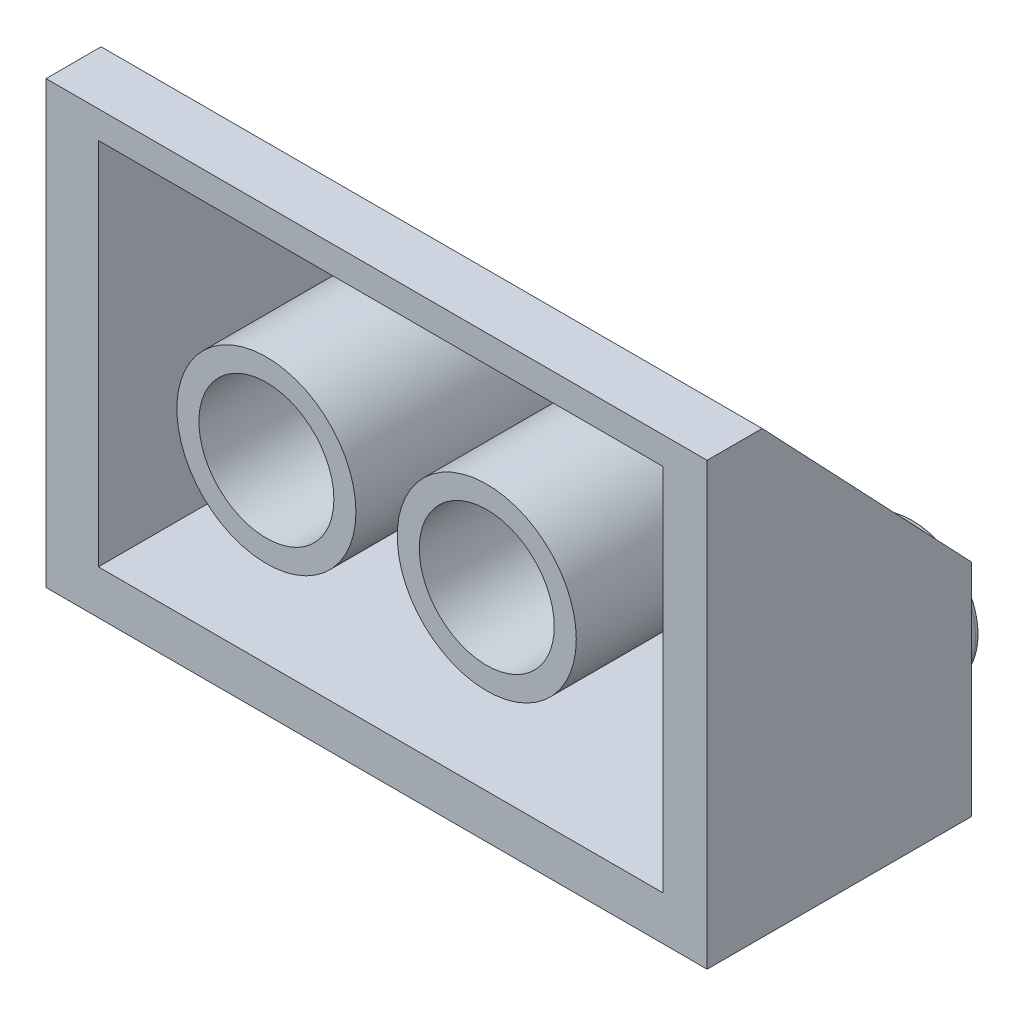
ISO-10303-21;
HEADER;
FILE_DESCRIPTION(('STEP AP214'),'2;1');
FILE_NAME('part.step','',(''),(''),'','','');
FILE_SCHEMA(('AUTOMOTIVE_DESIGN { 1 0 10303 214 1 1 1 1 }'));
ENDSEC;
DATA;
#1=APPLICATION_CONTEXT('core data for automotive mechanical design processes');
#2=APPLICATION_PROTOCOL_DEFINITION('international standard','automotive_design',2000,#1);
#3=PRODUCT_CONTEXT('',#1,'mechanical');
#4=PRODUCT('Part','Part','',(#3));
#5=PRODUCT_RELATED_PRODUCT_CATEGORY('part','',(#4));
#6=PRODUCT_DEFINITION_FORMATION('','',#4);
#7=PRODUCT_DEFINITION_CONTEXT('part definition',#1,'design');
#8=PRODUCT_DEFINITION('design','',#6,#7);
#9=PRODUCT_DEFINITION_SHAPE('','',#8);
#10=(LENGTH_UNIT() NAMED_UNIT(*) SI_UNIT(.MILLI.,.METRE.));
#11=(NAMED_UNIT(*) PLANE_ANGLE_UNIT() SI_UNIT($,.RADIAN.));
#12=(NAMED_UNIT(*) SI_UNIT($,.STERADIAN.) SOLID_ANGLE_UNIT());
#13=UNCERTAINTY_MEASURE_WITH_UNIT(LENGTH_MEASURE(1.E-05),#10,'distance_accuracy_value','');
#14=(GEOMETRIC_REPRESENTATION_CONTEXT(3) GLOBAL_UNCERTAINTY_ASSIGNED_CONTEXT((#13)) GLOBAL_UNIT_ASSIGNED_CONTEXT((#10,
#11,#12)) REPRESENTATION_CONTEXT('',''));
#15=CARTESIAN_POINT('',(0.,0.,0.));
#16=DIRECTION('',(0.,0.,1.));
#17=DIRECTION('',(1.,0.,0.));
#18=AXIS2_PLACEMENT_3D('',#15,#16,#17);
#19=CARTESIAN_POINT('',(0.,0.,0.));
#20=DIRECTION('',(0.,0.,-1.));
#21=DIRECTION('',(-1.,0.,0.));
#22=AXIS2_PLACEMENT_3D('',#19,#20,#21);
#23=PLANE('',#22);
#24=CARTESIAN_POINT('',(-4.,-4.,0.));
#25=DIRECTION('',(0.,0.,-1.));
#26=DIRECTION('',(-1.,0.,0.));
#27=AXIS2_PLACEMENT_3D('',#24,#25,#26);
#28=CIRCLE('',#27,2.45);
#29=CARTESIAN_POINT('',(-1.55,-4.,0.));
#30=VERTEX_POINT('',#29);
#31=EDGE_CURVE('E159',#30,#30,#28,.T.);
#32=ORIENTED_EDGE('',*,*,#31,.F.);
#33=EDGE_LOOP('',(#32));
#34=FACE_BOUND('',#33,.T.);
#35=DIRECTION('',(0.,1.,0.));
#36=VECTOR('',#35,1.);
#37=CARTESIAN_POINT('',(0.,0.,0.));
#38=LINE('',#37,#36);
#39=CARTESIAN_POINT('',(0.,-8.,0.));
#40=VERTEX_POINT('',#39);
#41=CARTESIAN_POINT('',(0.,0.,0.));
#42=VERTEX_POINT('',#41);
#43=EDGE_CURVE('E337',#40,#42,#38,.T.);
#44=ORIENTED_EDGE('',*,*,#43,.F.);
#45=DIRECTION('',(1.,0.,0.));
#46=VECTOR('',#45,1.);
#47=CARTESIAN_POINT('',(0.,-8.,0.));
#48=LINE('',#47,#46);
#49=CARTESIAN_POINT('',(-24.,-8.,0.));
#50=VERTEX_POINT('',#49);
#51=EDGE_CURVE('E346',#50,#40,#48,.T.);
#52=ORIENTED_EDGE('',*,*,#51,.F.);
#53=DIRECTION('',(0.,-1.,0.));
#54=VECTOR('',#53,1.);
#55=CARTESIAN_POINT('',(-24.,0.,0.));
#56=LINE('',#55,#54);
#57=CARTESIAN_POINT('',(-24.,0.,0.));
#58=VERTEX_POINT('',#57);
#59=EDGE_CURVE('E344',#58,#50,#56,.T.);
#60=ORIENTED_EDGE('',*,*,#59,.F.);
#61=DIRECTION('',(-1.,0.,0.));
#62=VECTOR('',#61,1.);
#63=CARTESIAN_POINT('',(0.,0.,0.));
#64=LINE('',#63,#62);
#65=EDGE_CURVE('E341',#42,#58,#64,.T.);
#66=ORIENTED_EDGE('',*,*,#65,.F.);
#67=EDGE_LOOP('',(#44,#52,#60,#66));
#68=FACE_BOUND('',#67,.T.);
#69=CARTESIAN_POINT('',(-12.,-4.,0.));
#70=DIRECTION('',(0.,0.,-1.));
#71=DIRECTION('',(-1.,0.,0.));
#72=AXIS2_PLACEMENT_3D('',#69,#70,#71);
#73=CIRCLE('',#72,2.45);
#74=CARTESIAN_POINT('',(-9.55,-4.,0.));
#75=VERTEX_POINT('',#74);
#76=EDGE_CURVE('E424',#75,#75,#73,.T.);
#77=ORIENTED_EDGE('',*,*,#76,.F.);
#78=EDGE_LOOP('',(#77));
#79=FACE_BOUND('',#78,.T.);
#80=CARTESIAN_POINT('',(-20.,-4.,0.));
#81=DIRECTION('',(0.,0.,-1.));
#82=DIRECTION('',(-1.,0.,0.));
#83=AXIS2_PLACEMENT_3D('',#80,#81,#82);
#84=CIRCLE('',#83,2.45);
#85=CARTESIAN_POINT('',(-17.55,-4.,0.));
#86=VERTEX_POINT('',#85);
#87=EDGE_CURVE('E167',#86,#86,#84,.T.);
#88=ORIENTED_EDGE('',*,*,#87,.F.);
#89=EDGE_LOOP('',(#88));
#90=FACE_BOUND('',#89,.T.);
#91=ADVANCED_FACE('F26',(#34,#68,#79,#90),#23,.T.);
#92=CARTESIAN_POINT('',(0.,0.,9.6));
#93=DIRECTION('',(0.,0.,-1.));
#94=DIRECTION('',(-1.,0.,0.));
#95=AXIS2_PLACEMENT_3D('',#92,#93,#94);
#96=PLANE('',#95);
#97=DIRECTION('',(0.,1.,0.));
#98=VECTOR('',#97,1.);
#99=CARTESIAN_POINT('',(0.,0.,9.6));
#100=LINE('',#99,#98);
#101=CARTESIAN_POINT('',(0.,-8.,9.6));
#102=VERTEX_POINT('',#101);
#103=CARTESIAN_POINT('',(0.,8.,9.6));
#104=VERTEX_POINT('',#103);
#105=EDGE_CURVE('E348',#102,#104,#100,.T.);
#106=ORIENTED_EDGE('',*,*,#105,.T.);
#107=DIRECTION('',(1.,0.,0.));
#108=VECTOR('',#107,1.);
#109=CARTESIAN_POINT('',(-24.,7.99999999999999,9.6));
#110=LINE('',#109,#108);
#111=CARTESIAN_POINT('',(-24.,7.99999999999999,9.6));
#112=VERTEX_POINT('',#111);
#113=EDGE_CURVE('E385',#112,#104,#110,.T.);
#114=ORIENTED_EDGE('',*,*,#113,.F.);
#115=DIRECTION('',(0.,-1.,0.));
#116=VECTOR('',#115,1.);
#117=CARTESIAN_POINT('',(-24.,0.,9.6));
#118=LINE('',#117,#116);
#119=CARTESIAN_POINT('',(-24.,-8.,9.6));
#120=VERTEX_POINT('',#119);
#121=EDGE_CURVE('E350',#112,#120,#118,.T.);
#122=ORIENTED_EDGE('',*,*,#121,.T.);
#123=DIRECTION('',(1.,0.,0.));
#124=VECTOR('',#123,1.);
#125=CARTESIAN_POINT('',(0.,-8.,9.6));
#126=LINE('',#125,#124);
#127=EDGE_CURVE('E352',#120,#102,#126,.T.);
#128=ORIENTED_EDGE('',*,*,#127,.T.);
#129=EDGE_LOOP('',(#106,#114,#122,#128));
#130=FACE_BOUND('',#129,.T.);
#131=DIRECTION('',(-1.,0.,0.));
#132=VECTOR('',#131,1.);
#133=CARTESIAN_POINT('',(-1.6,7.00522470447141,9.6));
#134=LINE('',#133,#132);
#135=CARTESIAN_POINT('',(-1.6,7.00522470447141,9.6));
#136=VERTEX_POINT('',#135);
#137=CARTESIAN_POINT('',(-22.1,7.0052247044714,9.6));
#138=VERTEX_POINT('',#137);
#139=EDGE_CURVE('E377',#136,#138,#134,.T.);
#140=ORIENTED_EDGE('',*,*,#139,.F.);
#141=DIRECTION('',(0.,1.,0.));
#142=VECTOR('',#141,1.);
#143=CARTESIAN_POINT('',(-1.6,-6.4,9.6));
#144=LINE('',#143,#142);
#145=CARTESIAN_POINT('',(-1.6,-6.4,9.6));
#146=VERTEX_POINT('',#145);
#147=EDGE_CURVE('E156',#146,#136,#144,.T.);
#148=ORIENTED_EDGE('',*,*,#147,.F.);
#149=DIRECTION('',(1.,0.,0.));
#150=VECTOR('',#149,1.);
#151=CARTESIAN_POINT('',(-1.6,-6.4,9.6));
#152=LINE('',#151,#150);
#153=CARTESIAN_POINT('',(-22.1,-6.40000000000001,9.6));
#154=VERTEX_POINT('',#153);
#155=EDGE_CURVE('E158',#154,#146,#152,.T.);
#156=ORIENTED_EDGE('',*,*,#155,.F.);
#157=DIRECTION('',(0.,1.,0.));
#158=VECTOR('',#157,1.);
#159=CARTESIAN_POINT('',(-22.1,0.,9.6));
#160=LINE('',#159,#158);
#161=EDGE_CURVE('E139',#154,#138,#160,.T.);
#162=ORIENTED_EDGE('',*,*,#161,.T.);
#163=EDGE_LOOP('',(#140,#148,#156,#162));
#164=FACE_BOUND('',#163,.T.);
#165=ADVANCED_FACE('F196',(#130,#164),#96,.F.);
#166=CARTESIAN_POINT('',(0.,0.,9.6));
#167=DIRECTION('',(-1.,0.,0.));
#168=DIRECTION('',(0.,-1.,0.));
#169=AXIS2_PLACEMENT_3D('',#166,#167,#168);
#170=PLANE('',#169);
#171=ORIENTED_EDGE('',*,*,#43,.T.);
#172=DIRECTION('',(0.,0.724999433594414,0.688749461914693));
#173=VECTOR('',#172,1.);
#174=CARTESIAN_POINT('',(0.,0.,0.));
#175=LINE('',#174,#173);
#176=CARTESIAN_POINT('',(0.,8.,7.6));
#177=VERTEX_POINT('',#176);
#178=EDGE_CURVE('E365',#42,#177,#175,.T.);
#179=ORIENTED_EDGE('',*,*,#178,.T.);
#180=DIRECTION('',(0.,0.,1.));
#181=VECTOR('',#180,1.);
#182=CARTESIAN_POINT('',(0.,8.,7.6));
#183=LINE('',#182,#181);
#184=EDGE_CURVE('E371',#177,#104,#183,.T.);
#185=ORIENTED_EDGE('',*,*,#184,.T.);
#186=ORIENTED_EDGE('',*,*,#105,.F.);
#187=DIRECTION('',(0.,0.,-1.));
#188=VECTOR('',#187,1.);
#189=CARTESIAN_POINT('',(0.,-8.,9.6));
#190=LINE('',#189,#188);
#191=EDGE_CURVE('E353',#102,#40,#190,.T.);
#192=ORIENTED_EDGE('',*,*,#191,.T.);
#193=EDGE_LOOP('',(#171,#179,#185,#186,#192));
#194=FACE_BOUND('',#193,.T.);
#195=ADVANCED_FACE('F203',(#194),#170,.F.);
#196=CARTESIAN_POINT('',(-24.,0.,9.6));
#197=DIRECTION('',(1.,0.,0.));
#198=DIRECTION('',(0.,0.,-1.));
#199=AXIS2_PLACEMENT_3D('',#196,#197,#198);
#200=PLANE('',#199);
#201=ORIENTED_EDGE('',*,*,#59,.T.);
#202=DIRECTION('',(0.,0.,-1.));
#203=VECTOR('',#202,1.);
#204=CARTESIAN_POINT('',(-24.,-8.,9.6));
#205=LINE('',#204,#203);
#206=EDGE_CURVE('E145',#120,#50,#205,.T.);
#207=ORIENTED_EDGE('',*,*,#206,.F.);
#208=ORIENTED_EDGE('',*,*,#121,.F.);
#209=DIRECTION('',(0.,0.,1.));
#210=VECTOR('',#209,1.);
#211=CARTESIAN_POINT('',(-24.,7.99999999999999,7.6));
#212=LINE('',#211,#210);
#213=CARTESIAN_POINT('',(-24.,7.99999999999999,7.6));
#214=VERTEX_POINT('',#213);
#215=EDGE_CURVE('E382',#214,#112,#212,.T.);
#216=ORIENTED_EDGE('',*,*,#215,.F.);
#217=DIRECTION('',(0.,0.724999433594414,0.688749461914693));
#218=VECTOR('',#217,1.);
#219=CARTESIAN_POINT('',(-24.,0.,0.));
#220=LINE('',#219,#218);
#221=EDGE_CURVE('E374',#58,#214,#220,.T.);
#222=ORIENTED_EDGE('',*,*,#221,.F.);
#223=EDGE_LOOP('',(#201,#207,#208,#216,#222));
#224=FACE_BOUND('',#223,.T.);
#225=ADVANCED_FACE('F216',(#224),#200,.F.);
#226=CARTESIAN_POINT('',(0.,-8.,9.6));
#227=DIRECTION('',(0.,1.,0.));
#228=DIRECTION('',(-1.,0.,0.));
#229=AXIS2_PLACEMENT_3D('',#226,#227,#228);
#230=PLANE('',#229);
#231=ORIENTED_EDGE('',*,*,#51,.T.);
#232=ORIENTED_EDGE('',*,*,#191,.F.);
#233=ORIENTED_EDGE('',*,*,#127,.F.);
#234=ORIENTED_EDGE('',*,*,#206,.T.);
#235=EDGE_LOOP('',(#231,#232,#233,#234));
#236=FACE_BOUND('',#235,.T.);
#237=ADVANCED_FACE('F212',(#236),#230,.F.);
#238=CARTESIAN_POINT('',(-1.6,6.2,1.1));
#239=DIRECTION('',(0.,0.,1.));
#240=DIRECTION('',(1.,0.,0.));
#241=AXIS2_PLACEMENT_3D('',#238,#239,#240);
#242=PLANE('',#241);
#243=CARTESIAN_POINT('',(-16.,0.,1.1));
#244=DIRECTION('',(0.,0.,1.));
#245=DIRECTION('',(1.,0.,0.));
#246=AXIS2_PLACEMENT_3D('',#243,#244,#245);
#247=CIRCLE('',#246,3.25);
#248=CARTESIAN_POINT('',(-19.25,0.,1.1));
#249=VERTEX_POINT('',#248);
#250=CARTESIAN_POINT('',(-12.75,0.,1.1));
#251=VERTEX_POINT('',#250);
#252=EDGE_CURVE('E439',#249,#251,#247,.T.);
#253=ORIENTED_EDGE('',*,*,#252,.F.);
#254=DIRECTION('',(-1.,0.,0.));
#255=VECTOR('',#254,1.);
#256=CARTESIAN_POINT('',(0.,0.,1.1));
#257=LINE('',#256,#255);
#258=CARTESIAN_POINT('',(-22.1,0.,1.1));
#259=VERTEX_POINT('',#258);
#260=EDGE_CURVE('E136',#249,#259,#257,.T.);
#261=ORIENTED_EDGE('',*,*,#260,.T.);
#262=DIRECTION('',(0.,-1.,0.));
#263=VECTOR('',#262,1.);
#264=CARTESIAN_POINT('',(-22.1,-6.40000000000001,1.1));
#265=LINE('',#264,#263);
#266=CARTESIAN_POINT('',(-22.1,-6.40000000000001,1.1));
#267=VERTEX_POINT('',#266);
#268=EDGE_CURVE('E330',#259,#267,#265,.T.);
#269=ORIENTED_EDGE('',*,*,#268,.T.);
#270=DIRECTION('',(1.,0.,0.));
#271=VECTOR('',#270,1.);
#272=CARTESIAN_POINT('',(-1.6,-6.4,1.1));
#273=LINE('',#272,#271);
#274=CARTESIAN_POINT('',(-1.6,-6.4,1.1));
#275=VERTEX_POINT('',#274);
#276=EDGE_CURVE('E324',#267,#275,#273,.T.);
#277=ORIENTED_EDGE('',*,*,#276,.T.);
#278=DIRECTION('',(0.,1.,0.));
#279=VECTOR('',#278,1.);
#280=CARTESIAN_POINT('',(-1.6,-6.4,1.1));
#281=LINE('',#280,#279);
#282=CARTESIAN_POINT('',(-1.6,0.,1.1));
#283=VERTEX_POINT('',#282);
#284=EDGE_CURVE('E327',#275,#283,#281,.T.);
#285=ORIENTED_EDGE('',*,*,#284,.T.);
#286=CARTESIAN_POINT('',(-4.75,0.,1.1));
#287=VERTEX_POINT('',#286);
#288=EDGE_CURVE('E140',#283,#287,#257,.T.);
#289=ORIENTED_EDGE('',*,*,#288,.T.);
#290=CARTESIAN_POINT('',(-8.,0.,1.1));
#291=DIRECTION('',(0.,0.,1.));
#292=DIRECTION('',(1.,0.,0.));
#293=AXIS2_PLACEMENT_3D('',#290,#291,#292);
#294=CIRCLE('',#293,3.25);
#295=CARTESIAN_POINT('',(-11.25,0.,1.1));
#296=VERTEX_POINT('',#295);
#297=EDGE_CURVE('E400',#296,#287,#294,.T.);
#298=ORIENTED_EDGE('',*,*,#297,.F.);
#299=EDGE_CURVE('E135',#296,#251,#257,.T.);
#300=ORIENTED_EDGE('',*,*,#299,.T.);
#301=EDGE_LOOP('',(#253,#261,#269,#277,#285,#289,#298,#300));
#302=FACE_BOUND('',#301,.T.);
#303=CARTESIAN_POINT('',(-20.,-4.00000000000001,1.1));
#304=DIRECTION('',(0.,0.,1.));
#305=DIRECTION('',(1.,0.,0.));
#306=AXIS2_PLACEMENT_3D('',#303,#304,#305);
#307=CIRCLE('',#306,1.25);
#308=CARTESIAN_POINT('',(-18.75,-4.00000000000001,1.1));
#309=VERTEX_POINT('',#308);
#310=EDGE_CURVE('E436',#309,#309,#307,.T.);
#311=ORIENTED_EDGE('',*,*,#310,.F.);
#312=EDGE_LOOP('',(#311));
#313=FACE_BOUND('',#312,.T.);
#314=CARTESIAN_POINT('',(-12.,-4.,1.1));
#315=DIRECTION('',(0.,0.,1.));
#316=DIRECTION('',(1.,0.,0.));
#317=AXIS2_PLACEMENT_3D('',#314,#315,#316);
#318=CIRCLE('',#317,1.25);
#319=CARTESIAN_POINT('',(-10.75,-4.,1.1));
#320=VERTEX_POINT('',#319);
#321=EDGE_CURVE('E430',#320,#320,#318,.T.);
#322=ORIENTED_EDGE('',*,*,#321,.F.);
#323=EDGE_LOOP('',(#322));
#324=FACE_BOUND('',#323,.T.);
#325=CARTESIAN_POINT('',(-4.,-4.,1.1));
#326=DIRECTION('',(0.,0.,1.));
#327=DIRECTION('',(1.,0.,0.));
#328=AXIS2_PLACEMENT_3D('',#325,#326,#327);
#329=CIRCLE('',#328,1.25);
#330=CARTESIAN_POINT('',(-2.75,-4.,1.1));
#331=VERTEX_POINT('',#330);
#332=EDGE_CURVE('E415',#331,#331,#329,.T.);
#333=ORIENTED_EDGE('',*,*,#332,.F.);
#334=EDGE_LOOP('',(#333));
#335=FACE_BOUND('',#334,.T.);
#336=ADVANCED_FACE('F215',(#302,#313,#324,#335),#242,.T.);
#337=CARTESIAN_POINT('',(-1.6,-6.4,1.1));
#338=DIRECTION('',(1.,0.,0.));
#339=DIRECTION('',(0.,0.,-1.));
#340=AXIS2_PLACEMENT_3D('',#337,#338,#339);
#341=PLANE('',#340);
#342=ORIENTED_EDGE('',*,*,#284,.F.);
#343=DIRECTION('',(0.,0.,1.));
#344=VECTOR('',#343,1.);
#345=CARTESIAN_POINT('',(-1.6,-6.4,1.1));
#346=LINE('',#345,#344);
#347=EDGE_CURVE('E325',#275,#146,#346,.T.);
#348=ORIENTED_EDGE('',*,*,#347,.T.);
#349=ORIENTED_EDGE('',*,*,#147,.T.);
#350=DIRECTION('',(0.,0.,1.));
#351=VECTOR('',#350,1.);
#352=CARTESIAN_POINT('',(-1.6,7.00522470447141,7.8));
#353=LINE('',#352,#351);
#354=CARTESIAN_POINT('',(-1.6,7.00522470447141,7.8));
#355=VERTEX_POINT('',#354);
#356=EDGE_CURVE('E392',#355,#136,#353,.T.);
#357=ORIENTED_EDGE('',*,*,#356,.F.);
#358=DIRECTION('',(0.,0.722675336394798,0.691187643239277));
#359=VECTOR('',#358,1.);
#360=CARTESIAN_POINT('',(-1.6,0.,1.1));
#361=LINE('',#360,#359);
#362=EDGE_CURVE('E395',#283,#355,#361,.T.);
#363=ORIENTED_EDGE('',*,*,#362,.F.);
#364=EDGE_LOOP('',(#342,#348,#349,#357,#363));
#365=FACE_BOUND('',#364,.T.);
#366=ADVANCED_FACE('F209',(#365),#341,.F.);
#367=CARTESIAN_POINT('',(-22.1,-6.40000000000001,1.1));
#368=DIRECTION('',(-1.,0.,0.));
#369=DIRECTION('',(0.,0.,1.));
#370=AXIS2_PLACEMENT_3D('',#367,#368,#369);
#371=PLANE('',#370);
#372=ORIENTED_EDGE('',*,*,#161,.F.);
#373=DIRECTION('',(0.,0.,1.));
#374=VECTOR('',#373,1.);
#375=CARTESIAN_POINT('',(-22.1,-6.40000000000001,1.1));
#376=LINE('',#375,#374);
#377=EDGE_CURVE('E313',#267,#154,#376,.T.);
#378=ORIENTED_EDGE('',*,*,#377,.F.);
#379=ORIENTED_EDGE('',*,*,#268,.F.);
#380=DIRECTION('',(0.,0.722675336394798,0.691187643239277));
#381=VECTOR('',#380,1.);
#382=CARTESIAN_POINT('',(-22.1,0.,1.1));
#383=LINE('',#382,#381);
#384=CARTESIAN_POINT('',(-22.1,7.0052247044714,7.8));
#385=VERTEX_POINT('',#384);
#386=EDGE_CURVE('E398',#259,#385,#383,.T.);
#387=ORIENTED_EDGE('',*,*,#386,.T.);
#388=DIRECTION('',(0.,0.,1.));
#389=VECTOR('',#388,1.);
#390=CARTESIAN_POINT('',(-22.1,7.0052247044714,7.8));
#391=LINE('',#390,#389);
#392=EDGE_CURVE('E316',#385,#138,#391,.T.);
#393=ORIENTED_EDGE('',*,*,#392,.T.);
#394=EDGE_LOOP('',(#372,#378,#379,#387,#393));
#395=FACE_BOUND('',#394,.T.);
#396=ADVANCED_FACE('F301',(#395),#371,.F.);
#397=CARTESIAN_POINT('',(-1.6,-6.4,1.1));
#398=DIRECTION('',(0.,-1.,0.));
#399=DIRECTION('',(1.,0.,0.));
#400=AXIS2_PLACEMENT_3D('',#397,#398,#399);
#401=PLANE('',#400);
#402=ORIENTED_EDGE('',*,*,#155,.T.);
#403=ORIENTED_EDGE('',*,*,#347,.F.);
#404=ORIENTED_EDGE('',*,*,#276,.F.);
#405=ORIENTED_EDGE('',*,*,#377,.T.);
#406=EDGE_LOOP('',(#402,#403,#404,#405));
#407=FACE_BOUND('',#406,.T.);
#408=ADVANCED_FACE('F295',(#407),#401,.F.);
#409=CARTESIAN_POINT('',(-4.,-4.,-1.9));
#410=DIRECTION('',(0.,0.,1.));
#411=DIRECTION('',(1.,0.,0.));
#412=AXIS2_PLACEMENT_3D('',#409,#410,#411);
#413=CYLINDRICAL_SURFACE('',#412,2.45);
#414=CARTESIAN_POINT('',(-4.,-4.,-1.7));
#415=DIRECTION('',(0.,0.,-1.));
#416=DIRECTION('',(-1.,0.,0.));
#417=AXIS2_PLACEMENT_3D('',#414,#415,#416);
#418=CIRCLE('',#417,2.45);
#419=CARTESIAN_POINT('',(-1.55,-4.,-1.7));
#420=VERTEX_POINT('',#419);
#421=EDGE_CURVE('E149',#420,#420,#418,.F.);
#422=CARTESIAN_POINT('',(-1.55,-4.,-1.7));
#423=CARTESIAN_POINT('',(-1.55,-4.,-1.68229166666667));
#424=CARTESIAN_POINT('',(-1.55,-4.,-1.66458333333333));
#425=CARTESIAN_POINT('',(-1.55,-4.,-1.62916666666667));
#426=CARTESIAN_POINT('',(-1.55,-4.,-1.61145833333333));
#427=CARTESIAN_POINT('',(-1.55,-4.,-1.57604166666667));
#428=CARTESIAN_POINT('',(-1.55,-4.,-1.55833333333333));
#429=CARTESIAN_POINT('',(-1.55,-4.,-1.52291666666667));
#430=CARTESIAN_POINT('',(-1.55,-4.,-1.50520833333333));
#431=CARTESIAN_POINT('',(-1.55,-4.,-1.46979166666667));
#432=CARTESIAN_POINT('',(-1.55,-4.,-1.45208333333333));
#433=CARTESIAN_POINT('',(-1.55,-4.,-1.41666666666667));
#434=CARTESIAN_POINT('',(-1.55,-4.,-1.39895833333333));
#435=CARTESIAN_POINT('',(-1.55,-4.,-1.36354166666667));
#436=CARTESIAN_POINT('',(-1.55,-4.,-1.34583333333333));
#437=CARTESIAN_POINT('',(-1.55,-4.,-1.31041666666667));
#438=CARTESIAN_POINT('',(-1.55,-4.,-1.29270833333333));
#439=CARTESIAN_POINT('',(-1.55,-4.,-1.25729166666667));
#440=CARTESIAN_POINT('',(-1.55,-4.,-1.23958333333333));
#441=CARTESIAN_POINT('',(-1.55,-4.,-1.20416666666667));
#442=CARTESIAN_POINT('',(-1.55,-4.,-1.18645833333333));
#443=CARTESIAN_POINT('',(-1.55,-4.,-1.15104166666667));
#444=CARTESIAN_POINT('',(-1.55,-4.,-1.13333333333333));
#445=CARTESIAN_POINT('',(-1.55,-4.,-1.09791666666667));
#446=CARTESIAN_POINT('',(-1.55,-4.,-1.08020833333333));
#447=CARTESIAN_POINT('',(-1.55,-4.,-1.04479166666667));
#448=CARTESIAN_POINT('',(-1.55,-4.,-1.02708333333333));
#449=CARTESIAN_POINT('',(-1.55,-4.,-0.991666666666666));
#450=CARTESIAN_POINT('',(-1.55,-4.,-0.973958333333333));
#451=CARTESIAN_POINT('',(-1.55,-4.,-0.938541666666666));
#452=CARTESIAN_POINT('',(-1.55,-4.,-0.920833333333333));
#453=CARTESIAN_POINT('',(-1.55,-4.,-0.885416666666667));
#454=CARTESIAN_POINT('',(-1.55,-4.,-0.867708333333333));
#455=CARTESIAN_POINT('',(-1.55,-4.,-0.832291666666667));
#456=CARTESIAN_POINT('',(-1.55,-4.,-0.814583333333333));
#457=CARTESIAN_POINT('',(-1.55,-4.,-0.779166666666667));
#458=CARTESIAN_POINT('',(-1.55,-4.,-0.761458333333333));
#459=CARTESIAN_POINT('',(-1.55,-4.,-0.726041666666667));
#460=CARTESIAN_POINT('',(-1.55,-4.,-0.708333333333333));
#461=CARTESIAN_POINT('',(-1.55,-4.,-0.672916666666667));
#462=CARTESIAN_POINT('',(-1.55,-4.,-0.655208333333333));
#463=CARTESIAN_POINT('',(-1.55,-4.,-0.619791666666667));
#464=CARTESIAN_POINT('',(-1.55,-4.,-0.602083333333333));
#465=CARTESIAN_POINT('',(-1.55,-4.,-0.566666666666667));
#466=CARTESIAN_POINT('',(-1.55,-4.,-0.548958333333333));
#467=CARTESIAN_POINT('',(-1.55,-4.,-0.513541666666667));
#468=CARTESIAN_POINT('',(-1.55,-4.,-0.495833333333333));
#469=CARTESIAN_POINT('',(-1.55,-4.,-0.460416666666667));
#470=CARTESIAN_POINT('',(-1.55,-4.,-0.442708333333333));
#471=CARTESIAN_POINT('',(-1.55,-4.,-0.407291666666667));
#472=CARTESIAN_POINT('',(-1.55,-4.,-0.389583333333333));
#473=CARTESIAN_POINT('',(-1.55,-4.,-0.354166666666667));
#474=CARTESIAN_POINT('',(-1.55,-4.,-0.336458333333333));
#475=CARTESIAN_POINT('',(-1.55,-4.,-0.301041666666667));
#476=CARTESIAN_POINT('',(-1.55,-4.,-0.283333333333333));
#477=CARTESIAN_POINT('',(-1.55,-4.,-0.247916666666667));
#478=CARTESIAN_POINT('',(-1.55,-4.,-0.230208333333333));
#479=CARTESIAN_POINT('',(-1.55,-4.,-0.194791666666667));
#480=CARTESIAN_POINT('',(-1.55,-4.,-0.177083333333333));
#481=CARTESIAN_POINT('',(-1.55,-4.,-0.141666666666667));
#482=CARTESIAN_POINT('',(-1.55,-4.,-0.123958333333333));
#483=CARTESIAN_POINT('',(-1.55,-4.,-0.0885416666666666));
#484=CARTESIAN_POINT('',(-1.55,-4.,-0.0708333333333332));
#485=CARTESIAN_POINT('',(-1.55,-4.,-0.0354166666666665));
#486=CARTESIAN_POINT('',(-1.55,-4.,-0.0177083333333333));
#487=CARTESIAN_POINT('',(-1.55,-4.,0.));
#488=B_SPLINE_CURVE_WITH_KNOTS('',3,(#422,#423,#424,#425,#426,#427,#428,#429,#430,#431,#432,
#433,#434,#435,#436,#437,#438,#439,#440,#441,#442,#443,#444,#445,#446,#447,#448,#449,#450,#451,
#452,#453,#454,#455,#456,#457,#458,#459,#460,#461,#462,#463,#464,#465,#466,#467,#468,#469,#470,
#471,#472,#473,#474,#475,#476,#477,#478,#479,#480,#481,#482,#483,#484,#485,#486,#487),
.UNSPECIFIED.,.F.,.F.,(4,2,2,2,2,2,2,2,2,2,2,2,2,2,2,2,2,2,2,2,2,2,2,2,2,2,2,2,2,2,2,2,4),(0.,
0.053125,0.10625,0.159375,0.2125,0.265625,0.31875,0.371875,0.425,0.478125,0.53125,0.584375,
0.6375,0.690625,0.74375,0.796875,0.85,0.903125,0.95625,1.009375,1.0625,1.115625,1.16875,
1.221875,1.275,1.328125,1.38125,1.434375,1.4875,1.540625,1.59375,1.646875,1.7),.UNSPECIFIED.);
#489=EDGE_CURVE('BSEAM291',#420,#30,#488,.T.);
#490=ORIENTED_EDGE('',*,*,#421,.T.);
#491=ORIENTED_EDGE('',*,*,#31,.T.);
#492=ORIENTED_EDGE('',*,*,#489,.T.);
#493=ORIENTED_EDGE('',*,*,#489,.F.);
#494=EDGE_LOOP('',(#490,#492,#491,#493));
#495=FACE_BOUND('',#494,.T.);
#496=ADVANCED_FACE('F291',(#495),#413,.T.);
#497=CARTESIAN_POINT('',(-4.,-4.,-1.9));
#498=DIRECTION('',(0.,0.,-1.));
#499=DIRECTION('',(-1.,0.,0.));
#500=AXIS2_PLACEMENT_3D('',#497,#498,#499);
#501=PLANE('',#500);
#502=CARTESIAN_POINT('',(-4.,-4.,-1.9));
#503=DIRECTION('',(0.,0.,-1.));
#504=DIRECTION('',(-1.,0.,0.));
#505=AXIS2_PLACEMENT_3D('',#502,#503,#504);
#506=CIRCLE('',#505,2.25);
#507=CARTESIAN_POINT('',(-6.25,-4.,-1.9));
#508=VERTEX_POINT('',#507);
#509=EDGE_CURVE('E144',#508,#508,#506,.T.);
#510=ORIENTED_EDGE('',*,*,#509,.T.);
#511=EDGE_LOOP('',(#510));
#512=FACE_BOUND('',#511,.T.);
#513=ADVANCED_FACE('F287',(#512),#501,.T.);
#514=CARTESIAN_POINT('',(-4.,-4.,-1.7));
#515=DIRECTION('',(0.,0.,-1.));
#516=DIRECTION('',(-1.,0.,0.));
#517=AXIS2_PLACEMENT_3D('',#514,#515,#516);
#518=TOROIDAL_SURFACE('',#517,2.25,0.2);
#519=ORIENTED_EDGE('',*,*,#421,.F.);
#520=EDGE_LOOP('',(#519));
#521=FACE_BOUND('',#520,.T.);
#522=ORIENTED_EDGE('',*,*,#509,.F.);
#523=EDGE_LOOP('',(#522));
#524=FACE_BOUND('',#523,.T.);
#525=ADVANCED_FACE('F280',(#521,#524),#518,.T.);
#526=CARTESIAN_POINT('',(-24.,7.99999999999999,7.6));
#527=DIRECTION('',(0.,1.,0.));
#528=DIRECTION('',(-1.,0.,0.));
#529=AXIS2_PLACEMENT_3D('',#526,#527,#528);
#530=PLANE('',#529);
#531=ORIENTED_EDGE('',*,*,#184,.F.);
#532=DIRECTION('',(1.,0.,0.));
#533=VECTOR('',#532,1.);
#534=CARTESIAN_POINT('',(-24.,7.99999999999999,7.6));
#535=LINE('',#534,#533);
#536=EDGE_CURVE('E369',#214,#177,#535,.T.);
#537=ORIENTED_EDGE('',*,*,#536,.F.);
#538=ORIENTED_EDGE('',*,*,#215,.T.);
#539=ORIENTED_EDGE('',*,*,#113,.T.);
#540=EDGE_LOOP('',(#531,#537,#538,#539));
#541=FACE_BOUND('',#540,.T.);
#542=ADVANCED_FACE('F277',(#541),#530,.T.);
#543=CARTESIAN_POINT('',(-24.,0.,0.));
#544=DIRECTION('',(0.,0.688749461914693,-0.724999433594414));
#545=DIRECTION('',(0.,0.724999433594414,0.688749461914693));
#546=AXIS2_PLACEMENT_3D('',#543,#544,#545);
#547=PLANE('',#546);
#548=ORIENTED_EDGE('',*,*,#221,.T.);
#549=ORIENTED_EDGE('',*,*,#536,.T.);
#550=ORIENTED_EDGE('',*,*,#178,.F.);
#551=ORIENTED_EDGE('',*,*,#65,.T.);
#552=EDGE_LOOP('',(#548,#549,#550,#551));
#553=FACE_BOUND('',#552,.T.);
#554=ADVANCED_FACE('F276',(#553),#547,.T.);
#555=CARTESIAN_POINT('',(-1.6,0.,1.1));
#556=DIRECTION('',(0.,-0.691187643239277,0.722675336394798));
#557=DIRECTION('',(0.,-0.722675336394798,-0.691187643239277));
#558=AXIS2_PLACEMENT_3D('',#555,#556,#557);
#559=PLANE('',#558);
#560=CARTESIAN_POINT('',(-16.,0.,1.09999999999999));
#561=DIRECTION('',(0.,-0.691187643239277,0.722675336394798));
#562=DIRECTION('',(0.,0.722675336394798,0.691187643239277));
#563=AXIS2_PLACEMENT_3D('',#560,#561,#562);
#564=ELLIPSE('',#563,4.49717852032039,3.25);
#565=EDGE_CURVE('E11',#251,#249,#564,.T.);
#566=ORIENTED_EDGE('',*,*,#565,.F.);
#567=ORIENTED_EDGE('',*,*,#299,.F.);
#568=CARTESIAN_POINT('',(-8.,0.,1.09999999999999));
#569=DIRECTION('',(0.,-0.691187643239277,0.722675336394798));
#570=DIRECTION('',(0.,0.722675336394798,0.691187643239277));
#571=AXIS2_PLACEMENT_3D('',#568,#569,#570);
#572=ELLIPSE('',#571,4.49717852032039,3.25);
#573=EDGE_CURVE('E164',#287,#296,#572,.T.);
#574=ORIENTED_EDGE('',*,*,#573,.F.);
#575=ORIENTED_EDGE('',*,*,#288,.F.);
#576=ORIENTED_EDGE('',*,*,#362,.T.);
#577=DIRECTION('',(-1.,0.,0.));
#578=VECTOR('',#577,1.);
#579=CARTESIAN_POINT('',(-1.6,7.00522470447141,7.8));
#580=LINE('',#579,#578);
#581=EDGE_CURVE('E372',#355,#385,#580,.T.);
#582=ORIENTED_EDGE('',*,*,#581,.T.);
#583=ORIENTED_EDGE('',*,*,#386,.F.);
#584=ORIENTED_EDGE('',*,*,#260,.F.);
#585=EDGE_LOOP('',(#566,#567,#574,#575,#576,#582,#583,#584));
#586=FACE_BOUND('',#585,.T.);
#587=ADVANCED_FACE('F272',(#586),#559,.T.);
#588=CARTESIAN_POINT('',(-1.6,7.00522470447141,7.8));
#589=DIRECTION('',(0.,-1.,0.));
#590=DIRECTION('',(1.,0.,0.));
#591=AXIS2_PLACEMENT_3D('',#588,#589,#590);
#592=PLANE('',#591);
#593=ORIENTED_EDGE('',*,*,#392,.F.);
#594=ORIENTED_EDGE('',*,*,#581,.F.);
#595=ORIENTED_EDGE('',*,*,#356,.T.);
#596=ORIENTED_EDGE('',*,*,#139,.T.);
#597=EDGE_LOOP('',(#593,#594,#595,#596));
#598=FACE_BOUND('',#597,.T.);
#599=ADVANCED_FACE('F260',(#598),#592,.T.);
#600=CARTESIAN_POINT('',(-8.,0.,1.1));
#601=DIRECTION('',(0.,0.,1.));
#602=DIRECTION('',(1.,0.,0.));
#603=AXIS2_PLACEMENT_3D('',#600,#601,#602);
#604=CYLINDRICAL_SURFACE('',#603,2.45);
#605=CARTESIAN_POINT('',(-8.,0.,1.09999999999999));
#606=DIRECTION('',(0.,-0.691187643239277,0.722675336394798));
#607=DIRECTION('',(0.,0.722675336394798,0.691187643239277));
#608=AXIS2_PLACEMENT_3D('',#605,#606,#607);
#609=ELLIPSE('',#608,3.39018073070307,2.45);
#610=CARTESIAN_POINT('',(-5.55,0.,1.1));
#611=VERTEX_POINT('',#610);
#612=CARTESIAN_POINT('',(-10.45,0.,1.1));
#613=VERTEX_POINT('',#612);
#614=EDGE_CURVE('E152',#611,#613,#609,.T.);
#615=ORIENTED_EDGE('',*,*,#614,.F.);
#616=CARTESIAN_POINT('',(-8.,0.,1.1));
#617=DIRECTION('',(0.,0.,1.));
#618=DIRECTION('',(1.,0.,0.));
#619=AXIS2_PLACEMENT_3D('',#616,#617,#618);
#620=CIRCLE('',#619,2.45);
#621=EDGE_CURVE('E406',#613,#611,#620,.T.);
#622=ORIENTED_EDGE('',*,*,#621,.F.);
#623=EDGE_LOOP('',(#615,#622));
#624=FACE_BOUND('',#623,.T.);
#625=CARTESIAN_POINT('',(-8.,0.,9.6));
#626=DIRECTION('',(0.,0.,1.));
#627=DIRECTION('',(1.,0.,0.));
#628=AXIS2_PLACEMENT_3D('',#625,#626,#627);
#629=CIRCLE('',#628,2.45);
#630=CARTESIAN_POINT('',(-5.55,0.,9.6));
#631=VERTEX_POINT('',#630);
#632=EDGE_CURVE('E409',#631,#631,#629,.T.);
#633=ORIENTED_EDGE('',*,*,#632,.T.);
#634=EDGE_LOOP('',(#633));
#635=FACE_BOUND('',#634,.T.);
#636=ADVANCED_FACE('F256',(#624,#635),#604,.F.);
#637=CARTESIAN_POINT('',(-8.,0.,9.6));
#638=DIRECTION('',(0.,0.,1.));
#639=DIRECTION('',(1.,0.,0.));
#640=AXIS2_PLACEMENT_3D('',#637,#638,#639);
#641=PLANE('',#640);
#642=ORIENTED_EDGE('',*,*,#632,.F.);
#643=EDGE_LOOP('',(#642));
#644=FACE_BOUND('',#643,.T.);
#645=CARTESIAN_POINT('',(-8.,0.,9.6));
#646=DIRECTION('',(0.,0.,1.));
#647=DIRECTION('',(1.,0.,0.));
#648=AXIS2_PLACEMENT_3D('',#645,#646,#647);
#649=CIRCLE('',#648,3.25);
#650=CARTESIAN_POINT('',(-4.75,0.,9.6));
#651=VERTEX_POINT('',#650);
#652=EDGE_CURVE('E403',#651,#651,#649,.T.);
#653=ORIENTED_EDGE('',*,*,#652,.T.);
#654=EDGE_LOOP('',(#653));
#655=FACE_BOUND('',#654,.T.);
#656=ADVANCED_FACE('F259',(#644,#655),#641,.T.);
#657=CARTESIAN_POINT('',(-8.,0.,1.1));
#658=DIRECTION('',(0.,0.,1.));
#659=DIRECTION('',(1.,0.,0.));
#660=AXIS2_PLACEMENT_3D('',#657,#658,#659);
#661=CYLINDRICAL_SURFACE('',#660,3.25);
#662=ORIENTED_EDGE('',*,*,#297,.T.);
#663=ORIENTED_EDGE('',*,*,#573,.T.);
#664=EDGE_LOOP('',(#662,#663));
#665=FACE_BOUND('',#664,.T.);
#666=ORIENTED_EDGE('',*,*,#652,.F.);
#667=EDGE_LOOP('',(#666));
#668=FACE_BOUND('',#667,.T.);
#669=ADVANCED_FACE('F264',(#665,#668),#661,.T.);
#670=EDGE_CURVE('E138',#611,#613,#257,.T.);
#671=ORIENTED_EDGE('',*,*,#670,.F.);
#672=ORIENTED_EDGE('',*,*,#614,.T.);
#673=EDGE_LOOP('',(#671,#672));
#674=FACE_BOUND('',#673,.T.);
#675=ADVANCED_FACE('F268',(#674),#559,.T.);
#676=ORIENTED_EDGE('',*,*,#670,.T.);
#677=ORIENTED_EDGE('',*,*,#621,.T.);
#678=EDGE_LOOP('',(#676,#677));
#679=FACE_BOUND('',#678,.T.);
#680=ADVANCED_FACE('F254',(#679),#242,.T.);
#681=CARTESIAN_POINT('',(-4.,-4.,-0.700000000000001));
#682=DIRECTION('',(0.,0.,1.));
#683=DIRECTION('',(1.,0.,0.));
#684=AXIS2_PLACEMENT_3D('',#681,#682,#683);
#685=CYLINDRICAL_SURFACE('',#684,1.25);
#686=CARTESIAN_POINT('',(-4.,-4.,-0.700000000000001));
#687=DIRECTION('',(0.,0.,1.));
#688=DIRECTION('',(1.,0.,0.));
#689=AXIS2_PLACEMENT_3D('',#686,#687,#688);
#690=CIRCLE('',#689,1.25);
#691=CARTESIAN_POINT('',(-2.75,-4.,-0.700000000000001));
#692=VERTEX_POINT('',#691);
#693=EDGE_CURVE('E412',#692,#692,#690,.T.);
#694=ORIENTED_EDGE('',*,*,#693,.F.);
#695=EDGE_LOOP('',(#694));
#696=FACE_BOUND('',#695,.T.);
#697=ORIENTED_EDGE('',*,*,#332,.T.);
#698=EDGE_LOOP('',(#697));
#699=FACE_BOUND('',#698,.T.);
#700=ADVANCED_FACE('F250',(#696,#699),#685,.F.);
#701=CARTESIAN_POINT('',(-4.,-4.,-0.700000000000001));
#702=DIRECTION('',(0.,0.,1.));
#703=DIRECTION('',(1.,0.,0.));
#704=AXIS2_PLACEMENT_3D('',#701,#702,#703);
#705=PLANE('',#704);
#706=ORIENTED_EDGE('',*,*,#693,.T.);
#707=EDGE_LOOP('',(#706));
#708=FACE_BOUND('',#707,.T.);
#709=ADVANCED_FACE('F190',(#708),#705,.T.);
#710=CARTESIAN_POINT('',(-12.,-4.,-1.9));
#711=DIRECTION('',(0.,0.,1.));
#712=DIRECTION('',(1.,0.,0.));
#713=AXIS2_PLACEMENT_3D('',#710,#711,#712);
#714=CYLINDRICAL_SURFACE('',#713,2.45);
#715=CARTESIAN_POINT('',(-12.,-4.,-1.7));
#716=DIRECTION('',(0.,0.,-1.));
#717=DIRECTION('',(-1.,0.,0.));
#718=AXIS2_PLACEMENT_3D('',#715,#716,#717);
#719=CIRCLE('',#718,2.45);
#720=CARTESIAN_POINT('',(-9.55,-4.,-1.7));
#721=VERTEX_POINT('',#720);
#722=EDGE_CURVE('E421',#721,#721,#719,.F.);
#723=CARTESIAN_POINT('',(-9.55,-4.,-1.7));
#724=CARTESIAN_POINT('',(-9.55,-4.,-1.68229166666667));
#725=CARTESIAN_POINT('',(-9.55,-4.,-1.66458333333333));
#726=CARTESIAN_POINT('',(-9.55,-4.,-1.62916666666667));
#727=CARTESIAN_POINT('',(-9.55,-4.,-1.61145833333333));
#728=CARTESIAN_POINT('',(-9.55,-4.,-1.57604166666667));
#729=CARTESIAN_POINT('',(-9.55,-4.,-1.55833333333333));
#730=CARTESIAN_POINT('',(-9.55,-4.,-1.52291666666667));
#731=CARTESIAN_POINT('',(-9.55,-4.,-1.50520833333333));
#732=CARTESIAN_POINT('',(-9.55,-4.,-1.46979166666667));
#733=CARTESIAN_POINT('',(-9.55,-4.,-1.45208333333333));
#734=CARTESIAN_POINT('',(-9.55,-4.,-1.41666666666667));
#735=CARTESIAN_POINT('',(-9.55,-4.,-1.39895833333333));
#736=CARTESIAN_POINT('',(-9.55,-4.,-1.36354166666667));
#737=CARTESIAN_POINT('',(-9.55,-4.,-1.34583333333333));
#738=CARTESIAN_POINT('',(-9.55,-4.,-1.31041666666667));
#739=CARTESIAN_POINT('',(-9.55,-4.,-1.29270833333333));
#740=CARTESIAN_POINT('',(-9.55,-4.,-1.25729166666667));
#741=CARTESIAN_POINT('',(-9.55,-4.,-1.23958333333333));
#742=CARTESIAN_POINT('',(-9.55,-4.,-1.20416666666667));
#743=CARTESIAN_POINT('',(-9.55,-4.,-1.18645833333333));
#744=CARTESIAN_POINT('',(-9.55,-4.,-1.15104166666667));
#745=CARTESIAN_POINT('',(-9.55,-4.,-1.13333333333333));
#746=CARTESIAN_POINT('',(-9.55,-4.,-1.09791666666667));
#747=CARTESIAN_POINT('',(-9.55,-4.,-1.08020833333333));
#748=CARTESIAN_POINT('',(-9.55,-4.,-1.04479166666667));
#749=CARTESIAN_POINT('',(-9.55,-4.,-1.02708333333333));
#750=CARTESIAN_POINT('',(-9.55,-4.,-0.991666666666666));
#751=CARTESIAN_POINT('',(-9.55,-4.,-0.973958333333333));
#752=CARTESIAN_POINT('',(-9.55,-4.,-0.938541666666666));
#753=CARTESIAN_POINT('',(-9.55,-4.,-0.920833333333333));
#754=CARTESIAN_POINT('',(-9.55,-4.,-0.885416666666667));
#755=CARTESIAN_POINT('',(-9.55,-4.,-0.867708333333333));
#756=CARTESIAN_POINT('',(-9.55,-4.,-0.832291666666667));
#757=CARTESIAN_POINT('',(-9.55,-4.,-0.814583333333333));
#758=CARTESIAN_POINT('',(-9.55,-4.,-0.779166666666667));
#759=CARTESIAN_POINT('',(-9.55,-4.,-0.761458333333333));
#760=CARTESIAN_POINT('',(-9.55,-4.,-0.726041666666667));
#761=CARTESIAN_POINT('',(-9.55,-4.,-0.708333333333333));
#762=CARTESIAN_POINT('',(-9.55,-4.,-0.672916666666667));
#763=CARTESIAN_POINT('',(-9.55,-4.,-0.655208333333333));
#764=CARTESIAN_POINT('',(-9.55,-4.,-0.619791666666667));
#765=CARTESIAN_POINT('',(-9.55,-4.,-0.602083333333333));
#766=CARTESIAN_POINT('',(-9.55,-4.,-0.566666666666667));
#767=CARTESIAN_POINT('',(-9.55,-4.,-0.548958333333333));
#768=CARTESIAN_POINT('',(-9.55,-4.,-0.513541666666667));
#769=CARTESIAN_POINT('',(-9.55,-4.,-0.495833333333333));
#770=CARTESIAN_POINT('',(-9.55,-4.,-0.460416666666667));
#771=CARTESIAN_POINT('',(-9.55,-4.,-0.442708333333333));
#772=CARTESIAN_POINT('',(-9.55,-4.,-0.407291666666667));
#773=CARTESIAN_POINT('',(-9.55,-4.,-0.389583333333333));
#774=CARTESIAN_POINT('',(-9.55,-4.,-0.354166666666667));
#775=CARTESIAN_POINT('',(-9.55,-4.,-0.336458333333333));
#776=CARTESIAN_POINT('',(-9.55,-4.,-0.301041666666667));
#777=CARTESIAN_POINT('',(-9.55,-4.,-0.283333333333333));
#778=CARTESIAN_POINT('',(-9.55,-4.,-0.247916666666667));
#779=CARTESIAN_POINT('',(-9.55,-4.,-0.230208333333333));
#780=CARTESIAN_POINT('',(-9.55,-4.,-0.194791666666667));
#781=CARTESIAN_POINT('',(-9.55,-4.,-0.177083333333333));
#782=CARTESIAN_POINT('',(-9.55,-4.,-0.141666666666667));
#783=CARTESIAN_POINT('',(-9.55,-4.,-0.123958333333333));
#784=CARTESIAN_POINT('',(-9.55,-4.,-0.0885416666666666));
#785=CARTESIAN_POINT('',(-9.55,-4.,-0.0708333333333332));
#786=CARTESIAN_POINT('',(-9.55,-4.,-0.0354166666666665));
#787=CARTESIAN_POINT('',(-9.55,-4.,-0.0177083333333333));
#788=CARTESIAN_POINT('',(-9.55,-4.,0.));
#789=B_SPLINE_CURVE_WITH_KNOTS('',3,(#723,#724,#725,#726,#727,#728,#729,#730,#731,#732,#733,
#734,#735,#736,#737,#738,#739,#740,#741,#742,#743,#744,#745,#746,#747,#748,#749,#750,#751,#752,
#753,#754,#755,#756,#757,#758,#759,#760,#761,#762,#763,#764,#765,#766,#767,#768,#769,#770,#771,
#772,#773,#774,#775,#776,#777,#778,#779,#780,#781,#782,#783,#784,#785,#786,#787,#788),
.UNSPECIFIED.,.F.,.F.,(4,2,2,2,2,2,2,2,2,2,2,2,2,2,2,2,2,2,2,2,2,2,2,2,2,2,2,2,2,2,2,2,4),(0.,
0.053125,0.10625,0.159375,0.2125,0.265625,0.31875,0.371875,0.425,0.478125,0.53125,0.584375,
0.6375,0.690625,0.74375,0.796875,0.85,0.903125,0.95625,1.009375,1.0625,1.115625,1.16875,
1.221875,1.275,1.328125,1.38125,1.434375,1.4875,1.540625,1.59375,1.646875,1.7),.UNSPECIFIED.);
#790=EDGE_CURVE('BSEAM181',#721,#75,#789,.T.);
#791=ORIENTED_EDGE('',*,*,#722,.T.);
#792=ORIENTED_EDGE('',*,*,#76,.T.);
#793=ORIENTED_EDGE('',*,*,#790,.T.);
#794=ORIENTED_EDGE('',*,*,#790,.F.);
#795=EDGE_LOOP('',(#791,#793,#792,#794));
#796=FACE_BOUND('',#795,.T.);
#797=ADVANCED_FACE('F181',(#796),#714,.T.);
#798=CARTESIAN_POINT('',(-12.,-4.,-1.9));
#799=DIRECTION('',(0.,0.,-1.));
#800=DIRECTION('',(-1.,0.,0.));
#801=AXIS2_PLACEMENT_3D('',#798,#799,#800);
#802=PLANE('',#801);
#803=CARTESIAN_POINT('',(-12.,-4.,-1.9));
#804=DIRECTION('',(0.,0.,-1.));
#805=DIRECTION('',(-1.,0.,0.));
#806=AXIS2_PLACEMENT_3D('',#803,#804,#805);
#807=CIRCLE('',#806,2.25);
#808=CARTESIAN_POINT('',(-14.25,-4.,-1.9));
#809=VERTEX_POINT('',#808);
#810=EDGE_CURVE('E418',#809,#809,#807,.T.);
#811=ORIENTED_EDGE('',*,*,#810,.T.);
#812=EDGE_LOOP('',(#811));
#813=FACE_BOUND('',#812,.T.);
#814=ADVANCED_FACE('F187',(#813),#802,.T.);
#815=CARTESIAN_POINT('',(-12.,-4.,-1.7));
#816=DIRECTION('',(0.,0.,-1.));
#817=DIRECTION('',(-1.,0.,0.));
#818=AXIS2_PLACEMENT_3D('',#815,#816,#817);
#819=TOROIDAL_SURFACE('',#818,2.25,0.2);
#820=ORIENTED_EDGE('',*,*,#722,.F.);
#821=EDGE_LOOP('',(#820));
#822=FACE_BOUND('',#821,.T.);
#823=ORIENTED_EDGE('',*,*,#810,.F.);
#824=EDGE_LOOP('',(#823));
#825=FACE_BOUND('',#824,.T.);
#826=ADVANCED_FACE('F179',(#822,#825),#819,.T.);
#827=CARTESIAN_POINT('',(-20.,-4.,-1.7));
#828=DIRECTION('',(0.,0.,-1.));
#829=DIRECTION('',(-1.,0.,0.));
#830=AXIS2_PLACEMENT_3D('',#827,#828,#829);
#831=TOROIDAL_SURFACE('',#830,2.25,0.2);
#832=CARTESIAN_POINT('',(-20.,-4.,-1.7));
#833=DIRECTION('',(0.,0.,-1.));
#834=DIRECTION('',(-1.,0.,0.));
#835=AXIS2_PLACEMENT_3D('',#832,#833,#834);
#836=CIRCLE('',#835,2.45);
#837=CARTESIAN_POINT('',(-17.55,-4.,-1.7));
#838=VERTEX_POINT('',#837);
#839=EDGE_CURVE('E170',#838,#838,#836,.F.);
#840=ORIENTED_EDGE('',*,*,#839,.F.);
#841=EDGE_LOOP('',(#840));
#842=FACE_BOUND('',#841,.T.);
#843=CARTESIAN_POINT('',(-20.,-4.,-1.9));
#844=DIRECTION('',(0.,0.,-1.));
#845=DIRECTION('',(-1.,0.,0.));
#846=AXIS2_PLACEMENT_3D('',#843,#844,#845);
#847=CIRCLE('',#846,2.25);
#848=CARTESIAN_POINT('',(-22.25,-4.,-1.9));
#849=VERTEX_POINT('',#848);
#850=EDGE_CURVE('E127',#849,#849,#847,.T.);
#851=ORIENTED_EDGE('',*,*,#850,.F.);
#852=EDGE_LOOP('',(#851));
#853=FACE_BOUND('',#852,.T.);
#854=ADVANCED_FACE('F28',(#842,#853),#831,.T.);
#855=CARTESIAN_POINT('',(-20.,-4.,-1.9));
#856=DIRECTION('',(0.,0.,-1.));
#857=DIRECTION('',(-1.,0.,0.));
#858=AXIS2_PLACEMENT_3D('',#855,#856,#857);
#859=PLANE('',#858);
#860=ORIENTED_EDGE('',*,*,#850,.T.);
#861=EDGE_LOOP('',(#860));
#862=FACE_BOUND('',#861,.T.);
#863=ADVANCED_FACE('F176',(#862),#859,.T.);
#864=CARTESIAN_POINT('',(-20.,-4.,-1.9));
#865=DIRECTION('',(0.,0.,1.));
#866=DIRECTION('',(1.,0.,0.));
#867=AXIS2_PLACEMENT_3D('',#864,#865,#866);
#868=CYLINDRICAL_SURFACE('',#867,2.45);
#869=CARTESIAN_POINT('',(-17.55,-4.,-1.7));
#870=CARTESIAN_POINT('',(-17.55,-4.,-1.68229166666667));
#871=CARTESIAN_POINT('',(-17.55,-4.,-1.66458333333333));
#872=CARTESIAN_POINT('',(-17.55,-4.,-1.62916666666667));
#873=CARTESIAN_POINT('',(-17.55,-4.,-1.61145833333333));
#874=CARTESIAN_POINT('',(-17.55,-4.,-1.57604166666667));
#875=CARTESIAN_POINT('',(-17.55,-4.,-1.55833333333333));
#876=CARTESIAN_POINT('',(-17.55,-4.,-1.52291666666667));
#877=CARTESIAN_POINT('',(-17.55,-4.,-1.50520833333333));
#878=CARTESIAN_POINT('',(-17.55,-4.,-1.46979166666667));
#879=CARTESIAN_POINT('',(-17.55,-4.,-1.45208333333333));
#880=CARTESIAN_POINT('',(-17.55,-4.,-1.41666666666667));
#881=CARTESIAN_POINT('',(-17.55,-4.,-1.39895833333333));
#882=CARTESIAN_POINT('',(-17.55,-4.,-1.36354166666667));
#883=CARTESIAN_POINT('',(-17.55,-4.,-1.34583333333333));
#884=CARTESIAN_POINT('',(-17.55,-4.,-1.31041666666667));
#885=CARTESIAN_POINT('',(-17.55,-4.,-1.29270833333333));
#886=CARTESIAN_POINT('',(-17.55,-4.,-1.25729166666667));
#887=CARTESIAN_POINT('',(-17.55,-4.,-1.23958333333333));
#888=CARTESIAN_POINT('',(-17.55,-4.,-1.20416666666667));
#889=CARTESIAN_POINT('',(-17.55,-4.,-1.18645833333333));
#890=CARTESIAN_POINT('',(-17.55,-4.,-1.15104166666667));
#891=CARTESIAN_POINT('',(-17.55,-4.,-1.13333333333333));
#892=CARTESIAN_POINT('',(-17.55,-4.,-1.09791666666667));
#893=CARTESIAN_POINT('',(-17.55,-4.,-1.08020833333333));
#894=CARTESIAN_POINT('',(-17.55,-4.,-1.04479166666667));
#895=CARTESIAN_POINT('',(-17.55,-4.,-1.02708333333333));
#896=CARTESIAN_POINT('',(-17.55,-4.,-0.991666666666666));
#897=CARTESIAN_POINT('',(-17.55,-4.,-0.973958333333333));
#898=CARTESIAN_POINT('',(-17.55,-4.,-0.938541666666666));
#899=CARTESIAN_POINT('',(-17.55,-4.,-0.920833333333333));
#900=CARTESIAN_POINT('',(-17.55,-4.,-0.885416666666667));
#901=CARTESIAN_POINT('',(-17.55,-4.,-0.867708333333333));
#902=CARTESIAN_POINT('',(-17.55,-4.,-0.832291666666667));
#903=CARTESIAN_POINT('',(-17.55,-4.,-0.814583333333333));
#904=CARTESIAN_POINT('',(-17.55,-4.,-0.779166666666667));
#905=CARTESIAN_POINT('',(-17.55,-4.,-0.761458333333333));
#906=CARTESIAN_POINT('',(-17.55,-4.,-0.726041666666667));
#907=CARTESIAN_POINT('',(-17.55,-4.,-0.708333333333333));
#908=CARTESIAN_POINT('',(-17.55,-4.,-0.672916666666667));
#909=CARTESIAN_POINT('',(-17.55,-4.,-0.655208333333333));
#910=CARTESIAN_POINT('',(-17.55,-4.,-0.619791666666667));
#911=CARTESIAN_POINT('',(-17.55,-4.,-0.602083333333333));
#912=CARTESIAN_POINT('',(-17.55,-4.,-0.566666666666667));
#913=CARTESIAN_POINT('',(-17.55,-4.,-0.548958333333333));
#914=CARTESIAN_POINT('',(-17.55,-4.,-0.513541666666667));
#915=CARTESIAN_POINT('',(-17.55,-4.,-0.495833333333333));
#916=CARTESIAN_POINT('',(-17.55,-4.,-0.460416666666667));
#917=CARTESIAN_POINT('',(-17.55,-4.,-0.442708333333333));
#918=CARTESIAN_POINT('',(-17.55,-4.,-0.407291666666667));
#919=CARTESIAN_POINT('',(-17.55,-4.,-0.389583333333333));
#920=CARTESIAN_POINT('',(-17.55,-4.,-0.354166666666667));
#921=CARTESIAN_POINT('',(-17.55,-4.,-0.336458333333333));
#922=CARTESIAN_POINT('',(-17.55,-4.,-0.301041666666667));
#923=CARTESIAN_POINT('',(-17.55,-4.,-0.283333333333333));
#924=CARTESIAN_POINT('',(-17.55,-4.,-0.247916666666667));
#925=CARTESIAN_POINT('',(-17.55,-4.,-0.230208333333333));
#926=CARTESIAN_POINT('',(-17.55,-4.,-0.194791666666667));
#927=CARTESIAN_POINT('',(-17.55,-4.,-0.177083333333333));
#928=CARTESIAN_POINT('',(-17.55,-4.,-0.141666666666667));
#929=CARTESIAN_POINT('',(-17.55,-4.,-0.123958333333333));
#930=CARTESIAN_POINT('',(-17.55,-4.,-0.0885416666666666));
#931=CARTESIAN_POINT('',(-17.55,-4.,-0.0708333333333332));
#932=CARTESIAN_POINT('',(-17.55,-4.,-0.0354166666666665));
#933=CARTESIAN_POINT('',(-17.55,-4.,-0.0177083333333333));
#934=CARTESIAN_POINT('',(-17.55,-4.,0.));
#935=B_SPLINE_CURVE_WITH_KNOTS('',3,(#869,#870,#871,#872,#873,#874,#875,#876,#877,#878,#879,
#880,#881,#882,#883,#884,#885,#886,#887,#888,#889,#890,#891,#892,#893,#894,#895,#896,#897,#898,
#899,#900,#901,#902,#903,#904,#905,#906,#907,#908,#909,#910,#911,#912,#913,#914,#915,#916,#917,
#918,#919,#920,#921,#922,#923,#924,#925,#926,#927,#928,#929,#930,#931,#932,#933,#934),
.UNSPECIFIED.,.F.,.F.,(4,2,2,2,2,2,2,2,2,2,2,2,2,2,2,2,2,2,2,2,2,2,2,2,2,2,2,2,2,2,2,2,4),(0.,
0.053125,0.10625,0.159375,0.2125,0.265625,0.31875,0.371875,0.425,0.478125,0.53125,0.584375,
0.6375,0.690625,0.74375,0.796875,0.85,0.903125,0.95625,1.009375,1.0625,1.115625,1.16875,
1.221875,1.275,1.328125,1.38125,1.434375,1.4875,1.540625,1.59375,1.646875,1.7),.UNSPECIFIED.);
#936=EDGE_CURVE('BSEAM186',#838,#86,#935,.T.);
#937=ORIENTED_EDGE('',*,*,#839,.T.);
#938=ORIENTED_EDGE('',*,*,#87,.T.);
#939=ORIENTED_EDGE('',*,*,#936,.T.);
#940=ORIENTED_EDGE('',*,*,#936,.F.);
#941=EDGE_LOOP('',(#937,#939,#938,#940));
#942=FACE_BOUND('',#941,.T.);
#943=ADVANCED_FACE('F186',(#942),#868,.T.);
#944=CARTESIAN_POINT('',(-12.,-4.,-0.700000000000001));
#945=DIRECTION('',(0.,0.,1.));
#946=DIRECTION('',(1.,0.,0.));
#947=AXIS2_PLACEMENT_3D('',#944,#945,#946);
#948=CYLINDRICAL_SURFACE('',#947,1.25);
#949=CARTESIAN_POINT('',(-12.,-4.,-0.700000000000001));
#950=DIRECTION('',(0.,0.,1.));
#951=DIRECTION('',(1.,0.,0.));
#952=AXIS2_PLACEMENT_3D('',#949,#950,#951);
#953=CIRCLE('',#952,1.25);
#954=CARTESIAN_POINT('',(-10.75,-4.,-0.700000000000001));
#955=VERTEX_POINT('',#954);
#956=EDGE_CURVE('E427',#955,#955,#953,.T.);
#957=ORIENTED_EDGE('',*,*,#956,.F.);
#958=EDGE_LOOP('',(#957));
#959=FACE_BOUND('',#958,.T.);
#960=ORIENTED_EDGE('',*,*,#321,.T.);
#961=EDGE_LOOP('',(#960));
#962=FACE_BOUND('',#961,.T.);
#963=ADVANCED_FACE('F225',(#959,#962),#948,.F.);
#964=CARTESIAN_POINT('',(-12.,-4.,-0.700000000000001));
#965=DIRECTION('',(0.,0.,1.));
#966=DIRECTION('',(1.,0.,0.));
#967=AXIS2_PLACEMENT_3D('',#964,#965,#966);
#968=PLANE('',#967);
#969=ORIENTED_EDGE('',*,*,#956,.T.);
#970=EDGE_LOOP('',(#969));
#971=FACE_BOUND('',#970,.T.);
#972=ADVANCED_FACE('F230',(#971),#968,.T.);
#973=CARTESIAN_POINT('',(-20.,-4.00000000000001,-0.700000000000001));
#974=DIRECTION('',(0.,0.,1.));
#975=DIRECTION('',(1.,0.,0.));
#976=AXIS2_PLACEMENT_3D('',#973,#974,#975);
#977=CYLINDRICAL_SURFACE('',#976,1.25);
#978=CARTESIAN_POINT('',(-20.,-4.00000000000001,-0.700000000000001));
#979=DIRECTION('',(0.,0.,1.));
#980=DIRECTION('',(1.,0.,0.));
#981=AXIS2_PLACEMENT_3D('',#978,#979,#980);
#982=CIRCLE('',#981,1.25);
#983=CARTESIAN_POINT('',(-18.75,-4.00000000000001,-0.700000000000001));
#984=VERTEX_POINT('',#983);
#985=EDGE_CURVE('E433',#984,#984,#982,.T.);
#986=ORIENTED_EDGE('',*,*,#985,.F.);
#987=EDGE_LOOP('',(#986));
#988=FACE_BOUND('',#987,.T.);
#989=ORIENTED_EDGE('',*,*,#310,.T.);
#990=EDGE_LOOP('',(#989));
#991=FACE_BOUND('',#990,.T.);
#992=ADVANCED_FACE('F239',(#988,#991),#977,.F.);
#993=CARTESIAN_POINT('',(-20.,-4.00000000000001,-0.700000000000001));
#994=DIRECTION('',(0.,0.,1.));
#995=DIRECTION('',(1.,0.,0.));
#996=AXIS2_PLACEMENT_3D('',#993,#994,#995);
#997=PLANE('',#996);
#998=ORIENTED_EDGE('',*,*,#985,.T.);
#999=EDGE_LOOP('',(#998));
#1000=FACE_BOUND('',#999,.T.);
#1001=ADVANCED_FACE('F462',(#1000),#997,.T.);
#1002=CARTESIAN_POINT('',(-16.,0.,1.1));
#1003=DIRECTION('',(0.,0.,1.));
#1004=DIRECTION('',(1.,0.,0.));
#1005=AXIS2_PLACEMENT_3D('',#1002,#1003,#1004);
#1006=CYLINDRICAL_SURFACE('',#1005,2.45);
#1007=CARTESIAN_POINT('',(-16.,0.,1.09999999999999));
#1008=DIRECTION('',(0.,-0.691187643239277,0.722675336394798));
#1009=DIRECTION('',(0.,0.722675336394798,0.691187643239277));
#1010=AXIS2_PLACEMENT_3D('',#1007,#1008,#1009);
#1011=ELLIPSE('',#1010,3.39018073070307,2.45);
#1012=CARTESIAN_POINT('',(-13.55,0.,1.1));
#1013=VERTEX_POINT('',#1012);
#1014=CARTESIAN_POINT('',(-18.45,0.,1.1));
#1015=VERTEX_POINT('',#1014);
#1016=EDGE_CURVE('E34',#1013,#1015,#1011,.T.);
#1017=ORIENTED_EDGE('',*,*,#1016,.F.);
#1018=CARTESIAN_POINT('',(-16.,0.,1.1));
#1019=DIRECTION('',(0.,0.,1.));
#1020=DIRECTION('',(1.,0.,0.));
#1021=AXIS2_PLACEMENT_3D('',#1018,#1019,#1020);
#1022=CIRCLE('',#1021,2.45);
#1023=EDGE_CURVE('E40',#1015,#1013,#1022,.T.);
#1024=ORIENTED_EDGE('',*,*,#1023,.F.);
#1025=EDGE_LOOP('',(#1017,#1024));
#1026=FACE_BOUND('',#1025,.T.);
#1027=CARTESIAN_POINT('',(-16.,0.,9.6));
#1028=DIRECTION('',(0.,0.,1.));
#1029=DIRECTION('',(1.,0.,0.));
#1030=AXIS2_PLACEMENT_3D('',#1027,#1028,#1029);
#1031=CIRCLE('',#1030,2.45);
#1032=CARTESIAN_POINT('',(-13.55,0.,9.6));
#1033=VERTEX_POINT('',#1032);
#1034=EDGE_CURVE('E132',#1033,#1033,#1031,.T.);
#1035=ORIENTED_EDGE('',*,*,#1034,.T.);
#1036=EDGE_LOOP('',(#1035));
#1037=FACE_BOUND('',#1036,.T.);
#1038=ADVANCED_FACE('F122',(#1026,#1037),#1006,.F.);
#1039=CARTESIAN_POINT('',(-16.,0.,9.6));
#1040=DIRECTION('',(0.,0.,1.));
#1041=DIRECTION('',(1.,0.,0.));
#1042=AXIS2_PLACEMENT_3D('',#1039,#1040,#1041);
#1043=PLANE('',#1042);
#1044=ORIENTED_EDGE('',*,*,#1034,.F.);
#1045=EDGE_LOOP('',(#1044));
#1046=FACE_BOUND('',#1045,.T.);
#1047=CARTESIAN_POINT('',(-16.,0.,9.6));
#1048=DIRECTION('',(0.,0.,1.));
#1049=DIRECTION('',(1.,0.,0.));
#1050=AXIS2_PLACEMENT_3D('',#1047,#1048,#1049);
#1051=CIRCLE('',#1050,3.25);
#1052=CARTESIAN_POINT('',(-12.75,0.,9.6));
#1053=VERTEX_POINT('',#1052);
#1054=EDGE_CURVE('E131',#1053,#1053,#1051,.T.);
#1055=ORIENTED_EDGE('',*,*,#1054,.T.);
#1056=EDGE_LOOP('',(#1055));
#1057=FACE_BOUND('',#1056,.T.);
#1058=ADVANCED_FACE('F447',(#1046,#1057),#1043,.T.);
#1059=CARTESIAN_POINT('',(-16.,0.,1.1));
#1060=DIRECTION('',(0.,0.,1.));
#1061=DIRECTION('',(1.,0.,0.));
#1062=AXIS2_PLACEMENT_3D('',#1059,#1060,#1061);
#1063=CYLINDRICAL_SURFACE('',#1062,3.25);
#1064=ORIENTED_EDGE('',*,*,#252,.T.);
#1065=ORIENTED_EDGE('',*,*,#565,.T.);
#1066=EDGE_LOOP('',(#1064,#1065));
#1067=FACE_BOUND('',#1066,.T.);
#1068=ORIENTED_EDGE('',*,*,#1054,.F.);
#1069=EDGE_LOOP('',(#1068));
#1070=FACE_BOUND('',#1069,.T.);
#1071=ADVANCED_FACE('F450',(#1067,#1070),#1063,.T.);
#1072=EDGE_CURVE('E130',#1013,#1015,#257,.T.);
#1073=ORIENTED_EDGE('',*,*,#1072,.F.);
#1074=ORIENTED_EDGE('',*,*,#1016,.T.);
#1075=EDGE_LOOP('',(#1073,#1074));
#1076=FACE_BOUND('',#1075,.T.);
#1077=ADVANCED_FACE('F134',(#1076),#559,.T.);
#1078=ORIENTED_EDGE('',*,*,#1072,.T.);
#1079=ORIENTED_EDGE('',*,*,#1023,.T.);
#1080=EDGE_LOOP('',(#1078,#1079));
#1081=FACE_BOUND('',#1080,.T.);
#1082=ADVANCED_FACE('F129',(#1081),#242,.T.);
#1083=CLOSED_SHELL('',(#91,#165,#195,#225,#237,#336,#366,#396,#408,#496,#513,#525,#542,#554,
#587,#599,#636,#656,#669,#675,#680,#700,#709,#797,#814,#826,#854,#863,#943,#963,#972,#992,#1001,
#1038,#1058,#1071,#1077,#1082));
#1084=MANIFOLD_SOLID_BREP('B2',#1083);
#1085=ADVANCED_BREP_SHAPE_REPRESENTATION('',(#18,#1084),#14);
#1086=SHAPE_DEFINITION_REPRESENTATION(#9,#1085);
ENDSEC;
END-ISO-10303-21;
